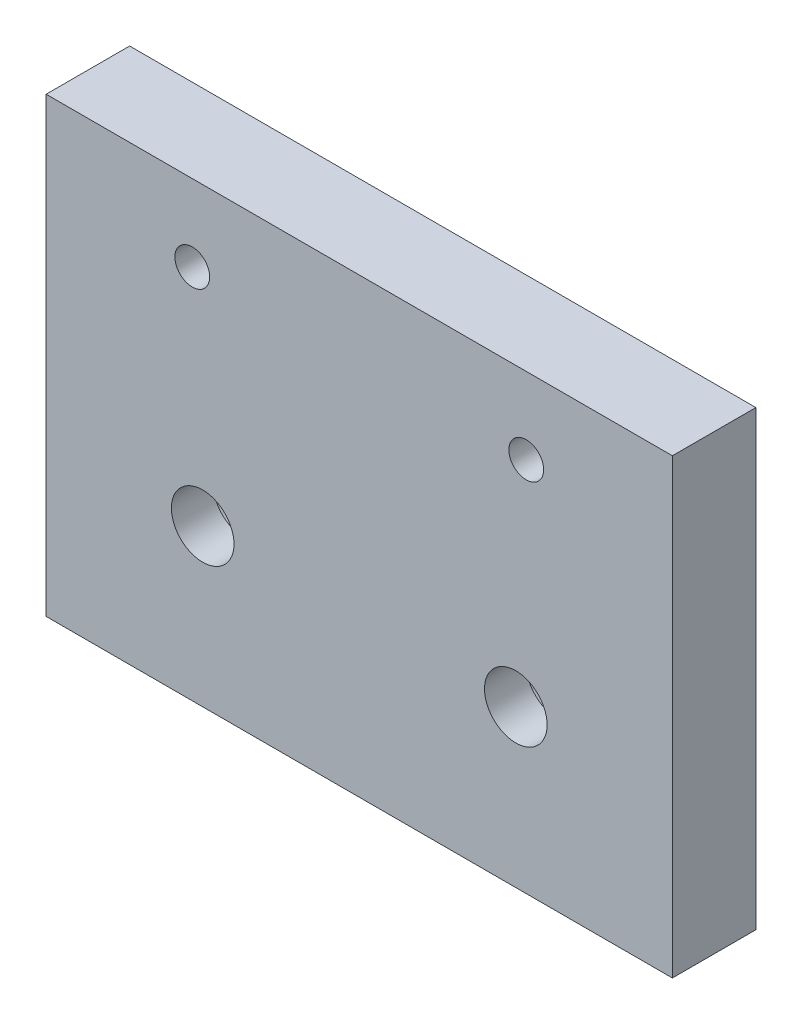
ISO-10303-21;
HEADER;
FILE_DESCRIPTION(('STEP AP214'),'2;1');
FILE_NAME('part.step','',(''),(''),'','','');
FILE_SCHEMA(('AUTOMOTIVE_DESIGN { 1 0 10303 214 1 1 1 1 }'));
ENDSEC;
DATA;
#1=APPLICATION_CONTEXT('core data for automotive mechanical design processes');
#2=APPLICATION_PROTOCOL_DEFINITION('international standard','automotive_design',2000,#1);
#3=PRODUCT_CONTEXT('',#1,'mechanical');
#4=PRODUCT('Part','Part','',(#3));
#5=PRODUCT_RELATED_PRODUCT_CATEGORY('part','',(#4));
#6=PRODUCT_DEFINITION_FORMATION('','',#4);
#7=PRODUCT_DEFINITION_CONTEXT('part definition',#1,'design');
#8=PRODUCT_DEFINITION('design','',#6,#7);
#9=PRODUCT_DEFINITION_SHAPE('','',#8);
#10=(LENGTH_UNIT() NAMED_UNIT(*) SI_UNIT(.MILLI.,.METRE.));
#11=(NAMED_UNIT(*) PLANE_ANGLE_UNIT() SI_UNIT($,.RADIAN.));
#12=(NAMED_UNIT(*) SI_UNIT($,.STERADIAN.) SOLID_ANGLE_UNIT());
#13=UNCERTAINTY_MEASURE_WITH_UNIT(LENGTH_MEASURE(1.E-05),#10,'distance_accuracy_value','');
#14=(GEOMETRIC_REPRESENTATION_CONTEXT(3) GLOBAL_UNCERTAINTY_ASSIGNED_CONTEXT((#13)) GLOBAL_UNIT_ASSIGNED_CONTEXT((#10,
#11,#12)) REPRESENTATION_CONTEXT('',''));
#15=CARTESIAN_POINT('',(0.,0.,0.));
#16=DIRECTION('',(0.,0.,1.));
#17=DIRECTION('',(1.,0.,0.));
#18=AXIS2_PLACEMENT_3D('',#15,#16,#17);
#19=CARTESIAN_POINT('',(22.5,0.,3.));
#20=DIRECTION('',(0.,0.,1.));
#21=DIRECTION('',(1.,0.,0.));
#22=AXIS2_PLACEMENT_3D('',#19,#20,#21);
#23=CYLINDRICAL_SURFACE('',#22,7.5);
#24=CARTESIAN_POINT('',(22.5,0.,6.));
#25=DIRECTION('',(0.,0.,1.));
#26=DIRECTION('',(1.,0.,0.));
#27=AXIS2_PLACEMENT_3D('',#24,#25,#26);
#28=CIRCLE('',#27,7.5);
#29=CARTESIAN_POINT('',(30.,0.,6.));
#30=VERTEX_POINT('',#29);
#31=EDGE_CURVE('E18',#30,#30,#28,.T.);
#32=ORIENTED_EDGE('',*,*,#31,.T.);
#33=EDGE_LOOP('',(#32));
#34=FACE_BOUND('',#33,.T.);
#35=CARTESIAN_POINT('',(22.5,0.,0.));
#36=DIRECTION('',(0.,0.,1.));
#37=DIRECTION('',(1.,0.,0.));
#38=AXIS2_PLACEMENT_3D('',#35,#36,#37);
#39=CIRCLE('',#38,7.5);
#40=CARTESIAN_POINT('',(30.,0.,0.));
#41=VERTEX_POINT('',#40);
#42=EDGE_CURVE('E105',#41,#41,#39,.F.);
#43=ORIENTED_EDGE('',*,*,#42,.T.);
#44=EDGE_LOOP('',(#43));
#45=FACE_BOUND('',#44,.T.);
#46=ADVANCED_FACE('F15',(#34,#45),#23,.F.);
#47=CARTESIAN_POINT('',(-22.5,0.,3.));
#48=DIRECTION('',(0.,0.,1.));
#49=DIRECTION('',(1.,0.,0.));
#50=AXIS2_PLACEMENT_3D('',#47,#48,#49);
#51=CYLINDRICAL_SURFACE('',#50,7.5);
#52=CARTESIAN_POINT('',(-22.5,0.,6.));
#53=DIRECTION('',(0.,0.,1.));
#54=DIRECTION('',(1.,0.,0.));
#55=AXIS2_PLACEMENT_3D('',#52,#53,#54);
#56=CIRCLE('',#55,7.5);
#57=CARTESIAN_POINT('',(-15.,0.,6.));
#58=VERTEX_POINT('',#57);
#59=EDGE_CURVE('E107',#58,#58,#56,.T.);
#60=ORIENTED_EDGE('',*,*,#59,.T.);
#61=EDGE_LOOP('',(#60));
#62=FACE_BOUND('',#61,.T.);
#63=CARTESIAN_POINT('',(-22.5,0.,0.));
#64=DIRECTION('',(0.,0.,1.));
#65=DIRECTION('',(1.,0.,0.));
#66=AXIS2_PLACEMENT_3D('',#63,#64,#65);
#67=CIRCLE('',#66,7.5);
#68=CARTESIAN_POINT('',(-15.,0.,0.));
#69=VERTEX_POINT('',#68);
#70=EDGE_CURVE('E67',#69,#69,#67,.F.);
#71=ORIENTED_EDGE('',*,*,#70,.T.);
#72=EDGE_LOOP('',(#71));
#73=FACE_BOUND('',#72,.T.);
#74=ADVANCED_FACE('F119',(#62,#73),#51,.F.);
#75=CARTESIAN_POINT('',(22.5,0.,6.));
#76=DIRECTION('',(0.,0.,1.));
#77=DIRECTION('',(1.,0.,0.));
#78=AXIS2_PLACEMENT_3D('',#75,#76,#77);
#79=PLANE('',#78);
#80=CARTESIAN_POINT('',(22.5,0.,5.99999999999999));
#81=DIRECTION('',(0.,0.,1.));
#82=DIRECTION('',(1.,0.,0.));
#83=AXIS2_PLACEMENT_3D('',#80,#81,#82);
#84=CIRCLE('',#83,4.5);
#85=CARTESIAN_POINT('',(27.,0.,5.99999999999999));
#86=VERTEX_POINT('',#85);
#87=EDGE_CURVE('E100',#86,#86,#84,.T.);
#88=ORIENTED_EDGE('',*,*,#87,.T.);
#89=EDGE_LOOP('',(#88));
#90=FACE_BOUND('',#89,.T.);
#91=ORIENTED_EDGE('',*,*,#31,.F.);
#92=EDGE_LOOP('',(#91));
#93=FACE_BOUND('',#92,.T.);
#94=ADVANCED_FACE('F116',(#90,#93),#79,.F.);
#95=CARTESIAN_POINT('',(-22.5,0.,6.));
#96=DIRECTION('',(0.,0.,1.));
#97=DIRECTION('',(1.,0.,0.));
#98=AXIS2_PLACEMENT_3D('',#95,#96,#97);
#99=PLANE('',#98);
#100=CARTESIAN_POINT('',(-22.5,0.,5.99999999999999));
#101=DIRECTION('',(0.,0.,1.));
#102=DIRECTION('',(1.,0.,0.));
#103=AXIS2_PLACEMENT_3D('',#100,#101,#102);
#104=CIRCLE('',#103,4.5);
#105=CARTESIAN_POINT('',(-18.,0.,5.99999999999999));
#106=VERTEX_POINT('',#105);
#107=EDGE_CURVE('E97',#106,#106,#104,.T.);
#108=ORIENTED_EDGE('',*,*,#107,.T.);
#109=EDGE_LOOP('',(#108));
#110=FACE_BOUND('',#109,.T.);
#111=ORIENTED_EDGE('',*,*,#59,.F.);
#112=EDGE_LOOP('',(#111));
#113=FACE_BOUND('',#112,.T.);
#114=ADVANCED_FACE('F118',(#110,#113),#99,.F.);
#115=CARTESIAN_POINT('',(0.,10.,0.));
#116=DIRECTION('',(0.,0.,1.));
#117=DIRECTION('',(1.,0.,0.));
#118=AXIS2_PLACEMENT_3D('',#115,#116,#117);
#119=PLANE('',#118);
#120=CARTESIAN_POINT('',(-24.,31.5,0.));
#121=DIRECTION('',(0.,0.,1.));
#122=DIRECTION('',(1.,0.,0.));
#123=AXIS2_PLACEMENT_3D('',#120,#121,#122);
#124=CIRCLE('',#123,2.5);
#125=CARTESIAN_POINT('',(-21.5,31.5,0.));
#126=VERTEX_POINT('',#125);
#127=EDGE_CURVE('E90',#126,#126,#124,.T.);
#128=ORIENTED_EDGE('',*,*,#127,.T.);
#129=EDGE_LOOP('',(#128));
#130=FACE_BOUND('',#129,.T.);
#131=CARTESIAN_POINT('',(24.,31.5,0.));
#132=DIRECTION('',(0.,0.,1.));
#133=DIRECTION('',(1.,0.,0.));
#134=AXIS2_PLACEMENT_3D('',#131,#132,#133);
#135=CIRCLE('',#134,2.5);
#136=CARTESIAN_POINT('',(26.5,31.5,0.));
#137=VERTEX_POINT('',#136);
#138=EDGE_CURVE('E94',#137,#137,#135,.T.);
#139=ORIENTED_EDGE('',*,*,#138,.T.);
#140=EDGE_LOOP('',(#139));
#141=FACE_BOUND('',#140,.T.);
#142=ORIENTED_EDGE('',*,*,#70,.F.);
#143=EDGE_LOOP('',(#142));
#144=FACE_BOUND('',#143,.T.);
#145=ORIENTED_EDGE('',*,*,#42,.F.);
#146=EDGE_LOOP('',(#145));
#147=FACE_BOUND('',#146,.T.);
#148=DIRECTION('',(0.,1.,0.));
#149=VECTOR('',#148,1.);
#150=CARTESIAN_POINT('',(-45.,-22.5,0.));
#151=LINE('',#150,#149);
#152=CARTESIAN_POINT('',(-45.,42.5,0.));
#153=VERTEX_POINT('',#152);
#154=CARTESIAN_POINT('',(-45.,-22.5,0.));
#155=VERTEX_POINT('',#154);
#156=EDGE_CURVE('E58',#153,#155,#151,.F.);
#157=ORIENTED_EDGE('',*,*,#156,.F.);
#158=DIRECTION('',(1.,0.,0.));
#159=VECTOR('',#158,1.);
#160=CARTESIAN_POINT('',(-45.,42.5,0.));
#161=LINE('',#160,#159);
#162=CARTESIAN_POINT('',(45.,42.5,0.));
#163=VERTEX_POINT('',#162);
#164=EDGE_CURVE('E248',#163,#153,#161,.F.);
#165=ORIENTED_EDGE('',*,*,#164,.F.);
#166=DIRECTION('',(0.,1.,0.));
#167=VECTOR('',#166,1.);
#168=CARTESIAN_POINT('',(45.,42.5,0.));
#169=LINE('',#168,#167);
#170=CARTESIAN_POINT('',(45.,-22.5,0.));
#171=VERTEX_POINT('',#170);
#172=EDGE_CURVE('E70',#171,#163,#169,.T.);
#173=ORIENTED_EDGE('',*,*,#172,.F.);
#174=DIRECTION('',(1.,0.,0.));
#175=VECTOR('',#174,1.);
#176=CARTESIAN_POINT('',(45.,-22.5,0.));
#177=LINE('',#176,#175);
#178=EDGE_CURVE('E53',#155,#171,#177,.T.);
#179=ORIENTED_EDGE('',*,*,#178,.F.);
#180=EDGE_LOOP('',(#157,#165,#173,#179));
#181=FACE_BOUND('',#180,.T.);
#182=ADVANCED_FACE('F69',(#130,#141,#144,#147,#181),#119,.F.);
#183=CARTESIAN_POINT('',(-45.,-22.5,0.));
#184=DIRECTION('',(-1.,0.,0.));
#185=DIRECTION('',(0.,0.,1.));
#186=AXIS2_PLACEMENT_3D('',#183,#184,#185);
#187=PLANE('',#186);
#188=ORIENTED_EDGE('',*,*,#156,.T.);
#189=DIRECTION('',(0.,0.,-1.));
#190=VECTOR('',#189,1.);
#191=CARTESIAN_POINT('',(-45.,-22.5,0.));
#192=LINE('',#191,#190);
#193=CARTESIAN_POINT('',(-45.,-22.5,12.));
#194=VERTEX_POINT('',#193);
#195=EDGE_CURVE('E60',#194,#155,#192,.T.);
#196=ORIENTED_EDGE('',*,*,#195,.F.);
#197=DIRECTION('',(0.,1.,0.));
#198=VECTOR('',#197,1.);
#199=CARTESIAN_POINT('',(-45.,10.,12.));
#200=LINE('',#199,#198);
#201=CARTESIAN_POINT('',(-45.,42.5,12.));
#202=VERTEX_POINT('',#201);
#203=EDGE_CURVE('E93',#202,#194,#200,.F.);
#204=ORIENTED_EDGE('',*,*,#203,.F.);
#205=DIRECTION('',(0.,0.,1.));
#206=VECTOR('',#205,1.);
#207=CARTESIAN_POINT('',(-45.,42.5,0.));
#208=LINE('',#207,#206);
#209=EDGE_CURVE('E63',#153,#202,#208,.T.);
#210=ORIENTED_EDGE('',*,*,#209,.F.);
#211=EDGE_LOOP('',(#188,#196,#204,#210));
#212=FACE_BOUND('',#211,.T.);
#213=ADVANCED_FACE('F59',(#212),#187,.T.);
#214=CARTESIAN_POINT('',(45.,-22.5,0.));
#215=DIRECTION('',(0.,-1.,0.));
#216=DIRECTION('',(0.,0.,-1.));
#217=AXIS2_PLACEMENT_3D('',#214,#215,#216);
#218=PLANE('',#217);
#219=ORIENTED_EDGE('',*,*,#178,.T.);
#220=DIRECTION('',(0.,0.,-1.));
#221=VECTOR('',#220,1.);
#222=CARTESIAN_POINT('',(45.,-22.5,0.));
#223=LINE('',#222,#221);
#224=CARTESIAN_POINT('',(45.,-22.5,12.));
#225=VERTEX_POINT('',#224);
#226=EDGE_CURVE('E72',#225,#171,#223,.T.);
#227=ORIENTED_EDGE('',*,*,#226,.F.);
#228=DIRECTION('',(1.,0.,0.));
#229=VECTOR('',#228,1.);
#230=CARTESIAN_POINT('',(0.,-22.5,12.));
#231=LINE('',#230,#229);
#232=EDGE_CURVE('E76',#194,#225,#231,.T.);
#233=ORIENTED_EDGE('',*,*,#232,.F.);
#234=ORIENTED_EDGE('',*,*,#195,.T.);
#235=EDGE_LOOP('',(#219,#227,#233,#234));
#236=FACE_BOUND('',#235,.T.);
#237=ADVANCED_FACE('F74',(#236),#218,.T.);
#238=CARTESIAN_POINT('',(45.,42.5,0.));
#239=DIRECTION('',(1.,0.,0.));
#240=DIRECTION('',(0.,0.,-1.));
#241=AXIS2_PLACEMENT_3D('',#238,#239,#240);
#242=PLANE('',#241);
#243=ORIENTED_EDGE('',*,*,#172,.T.);
#244=DIRECTION('',(0.,0.,1.));
#245=VECTOR('',#244,1.);
#246=CARTESIAN_POINT('',(45.,42.5,0.));
#247=LINE('',#246,#245);
#248=CARTESIAN_POINT('',(45.,42.5,12.));
#249=VERTEX_POINT('',#248);
#250=EDGE_CURVE('E33',#249,#163,#247,.F.);
#251=ORIENTED_EDGE('',*,*,#250,.F.);
#252=DIRECTION('',(0.,1.,0.));
#253=VECTOR('',#252,1.);
#254=CARTESIAN_POINT('',(45.,10.,12.));
#255=LINE('',#254,#253);
#256=EDGE_CURVE('E241',#225,#249,#255,.T.);
#257=ORIENTED_EDGE('',*,*,#256,.F.);
#258=ORIENTED_EDGE('',*,*,#226,.T.);
#259=EDGE_LOOP('',(#243,#251,#257,#258));
#260=FACE_BOUND('',#259,.T.);
#261=ADVANCED_FACE('F156',(#260),#242,.T.);
#262=CARTESIAN_POINT('',(-45.,42.5,0.));
#263=DIRECTION('',(0.,1.,0.));
#264=DIRECTION('',(0.,0.,1.));
#265=AXIS2_PLACEMENT_3D('',#262,#263,#264);
#266=PLANE('',#265);
#267=ORIENTED_EDGE('',*,*,#164,.T.);
#268=ORIENTED_EDGE('',*,*,#209,.T.);
#269=DIRECTION('',(1.,0.,0.));
#270=VECTOR('',#269,1.);
#271=CARTESIAN_POINT('',(0.,42.5,12.));
#272=LINE('',#271,#270);
#273=EDGE_CURVE('E89',#249,#202,#272,.F.);
#274=ORIENTED_EDGE('',*,*,#273,.F.);
#275=ORIENTED_EDGE('',*,*,#250,.T.);
#276=EDGE_LOOP('',(#267,#268,#274,#275));
#277=FACE_BOUND('',#276,.T.);
#278=ADVANCED_FACE('F152',(#277),#266,.T.);
#279=CARTESIAN_POINT('',(22.5,0.,111.664676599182));
#280=DIRECTION('',(0.,0.,1.));
#281=DIRECTION('',(1.,0.,0.));
#282=AXIS2_PLACEMENT_3D('',#279,#280,#281);
#283=CYLINDRICAL_SURFACE('',#282,4.5);
#284=ORIENTED_EDGE('',*,*,#87,.F.);
#285=EDGE_LOOP('',(#284));
#286=FACE_BOUND('',#285,.T.);
#287=CARTESIAN_POINT('',(22.5,0.,12.));
#288=DIRECTION('',(0.,0.,1.));
#289=DIRECTION('',(1.,0.,0.));
#290=AXIS2_PLACEMENT_3D('',#287,#288,#289);
#291=CIRCLE('',#290,4.5);
#292=CARTESIAN_POINT('',(27.,0.,12.));
#293=VERTEX_POINT('',#292);
#294=EDGE_CURVE('E86',#293,#293,#291,.F.);
#295=ORIENTED_EDGE('',*,*,#294,.F.);
#296=EDGE_LOOP('',(#295));
#297=FACE_BOUND('',#296,.T.);
#298=ADVANCED_FACE('F148',(#286,#297),#283,.F.);
#299=CARTESIAN_POINT('',(-22.5,0.,111.664676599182));
#300=DIRECTION('',(0.,0.,1.));
#301=DIRECTION('',(1.,0.,0.));
#302=AXIS2_PLACEMENT_3D('',#299,#300,#301);
#303=CYLINDRICAL_SURFACE('',#302,4.5);
#304=ORIENTED_EDGE('',*,*,#107,.F.);
#305=EDGE_LOOP('',(#304));
#306=FACE_BOUND('',#305,.T.);
#307=CARTESIAN_POINT('',(-22.5,0.,12.));
#308=DIRECTION('',(0.,0.,1.));
#309=DIRECTION('',(1.,0.,0.));
#310=AXIS2_PLACEMENT_3D('',#307,#308,#309);
#311=CIRCLE('',#310,4.5);
#312=CARTESIAN_POINT('',(-18.,0.,12.));
#313=VERTEX_POINT('',#312);
#314=EDGE_CURVE('E83',#313,#313,#311,.F.);
#315=ORIENTED_EDGE('',*,*,#314,.F.);
#316=EDGE_LOOP('',(#315));
#317=FACE_BOUND('',#316,.T.);
#318=ADVANCED_FACE('F144',(#306,#317),#303,.F.);
#319=CARTESIAN_POINT('',(24.,31.5,0.));
#320=DIRECTION('',(0.,0.,1.));
#321=DIRECTION('',(1.,0.,0.));
#322=AXIS2_PLACEMENT_3D('',#319,#320,#321);
#323=CYLINDRICAL_SURFACE('',#322,2.5);
#324=ORIENTED_EDGE('',*,*,#138,.F.);
#325=EDGE_LOOP('',(#324));
#326=FACE_BOUND('',#325,.T.);
#327=CARTESIAN_POINT('',(24.,31.5,12.));
#328=DIRECTION('',(0.,0.,1.));
#329=DIRECTION('',(1.,0.,0.));
#330=AXIS2_PLACEMENT_3D('',#327,#328,#329);
#331=CIRCLE('',#330,2.5);
#332=CARTESIAN_POINT('',(26.5,31.5,12.));
#333=VERTEX_POINT('',#332);
#334=EDGE_CURVE('E24',#333,#333,#331,.F.);
#335=ORIENTED_EDGE('',*,*,#334,.F.);
#336=EDGE_LOOP('',(#335));
#337=FACE_BOUND('',#336,.T.);
#338=ADVANCED_FACE('F137',(#326,#337),#323,.F.);
#339=CARTESIAN_POINT('',(-24.,31.5,0.));
#340=DIRECTION('',(0.,0.,1.));
#341=DIRECTION('',(1.,0.,0.));
#342=AXIS2_PLACEMENT_3D('',#339,#340,#341);
#343=CYLINDRICAL_SURFACE('',#342,2.5);
#344=ORIENTED_EDGE('',*,*,#127,.F.);
#345=EDGE_LOOP('',(#344));
#346=FACE_BOUND('',#345,.T.);
#347=CARTESIAN_POINT('',(-24.,31.5,12.));
#348=DIRECTION('',(0.,0.,1.));
#349=DIRECTION('',(1.,0.,0.));
#350=AXIS2_PLACEMENT_3D('',#347,#348,#349);
#351=CIRCLE('',#350,2.5);
#352=CARTESIAN_POINT('',(-21.5,31.5,12.));
#353=VERTEX_POINT('',#352);
#354=EDGE_CURVE('E10',#353,#353,#351,.F.);
#355=ORIENTED_EDGE('',*,*,#354,.F.);
#356=EDGE_LOOP('',(#355));
#357=FACE_BOUND('',#356,.T.);
#358=ADVANCED_FACE('F131',(#346,#357),#343,.F.);
#359=CARTESIAN_POINT('',(0.,10.,12.));
#360=DIRECTION('',(0.,0.,1.));
#361=DIRECTION('',(1.,0.,0.));
#362=AXIS2_PLACEMENT_3D('',#359,#360,#361);
#363=PLANE('',#362);
#364=ORIENTED_EDGE('',*,*,#354,.T.);
#365=EDGE_LOOP('',(#364));
#366=FACE_BOUND('',#365,.T.);
#367=ORIENTED_EDGE('',*,*,#334,.T.);
#368=EDGE_LOOP('',(#367));
#369=FACE_BOUND('',#368,.T.);
#370=ORIENTED_EDGE('',*,*,#314,.T.);
#371=EDGE_LOOP('',(#370));
#372=FACE_BOUND('',#371,.T.);
#373=ORIENTED_EDGE('',*,*,#294,.T.);
#374=EDGE_LOOP('',(#373));
#375=FACE_BOUND('',#374,.T.);
#376=ORIENTED_EDGE('',*,*,#256,.T.);
#377=ORIENTED_EDGE('',*,*,#273,.T.);
#378=ORIENTED_EDGE('',*,*,#203,.T.);
#379=ORIENTED_EDGE('',*,*,#232,.T.);
#380=EDGE_LOOP('',(#376,#377,#378,#379));
#381=FACE_BOUND('',#380,.T.);
#382=ADVANCED_FACE('F129',(#366,#369,#372,#375,#381),#363,.T.);
#383=CLOSED_SHELL('',(#46,#74,#94,#114,#182,#213,#237,#261,#278,#298,#318,#338,#358,#382));
#384=MANIFOLD_SOLID_BREP('B1',#383);
#385=ADVANCED_BREP_SHAPE_REPRESENTATION('',(#18,#384),#14);
#386=SHAPE_DEFINITION_REPRESENTATION(#9,#385);
ENDSEC;
END-ISO-10303-21;
